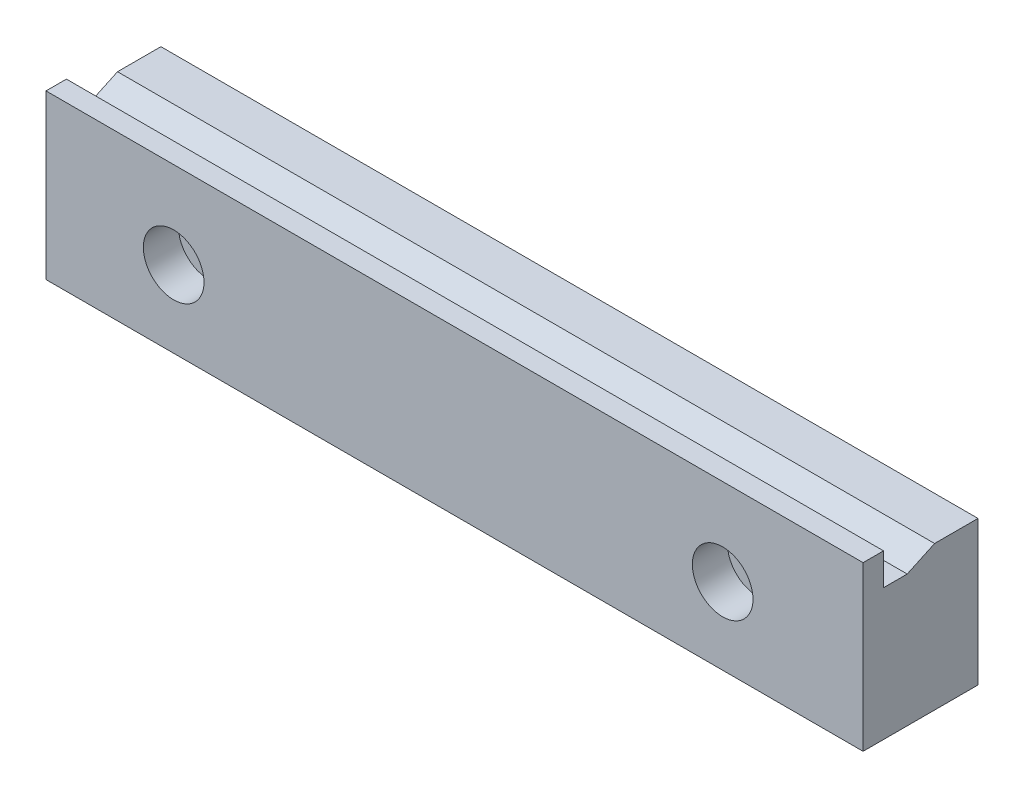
from build123d import *

# Parameters (mm, degrees)
SKETCH_1_W          = 128
SKETCH_1_H          = 25.6
SKETCH_1_R          = 2.75
EXTRUDE_1_DEPTH     = 18
SKETCH_2_R          = 4.75
CUT_EXTRUDE_1_DEPTH = 5.5
SKETCH_3_OUTSIDE_W  = 46.354
SKETCH_3_OUTSIDE_H  = 53.954
CUT_EXTRUDE_2_DEPTH = 132.770102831


with BuildPart() as part:
    # Sketch 1 → Extrude 1 (new body)
    with BuildSketch(Plane.XY):
        with Locations((64, 12.8)):
            Rectangle(SKETCH_1_W, SKETCH_1_H)
        with Locations((106, 12)):
            Circle(SKETCH_1_R, mode=Mode.SUBTRACT)
        with Locations((20, 12)):
            Circle(SKETCH_1_R, mode=Mode.SUBTRACT)
    extrude(amount=EXTRUDE_1_DEPTH)

    # Sketch 2 → Cut-Extrude 1 (cut)
    with BuildSketch(Plane.XY.offset(18)):
        with Locations((106, 12)):
            Circle(SKETCH_2_R)
        with Locations((20, 12)):
            Circle(SKETCH_2_R)
    extrude(amount=-CUT_EXTRUDE_1_DEPTH, mode=Mode.SUBTRACT)

    # Sketch 3 outside → Cut-Extrude 2 (cut, through all)
    with BuildSketch(Plane(origin=(128, 0, 0), x_dir=(0, 0, -1), z_dir=(1, 0, 0))):
        with Locations((-9, 12.8)):
            Rectangle(SKETCH_3_OUTSIDE_W, SKETCH_3_OUTSIDE_H)
        Polygon((-18, 0), (0, 0), (0, 22.6), (-6.8, 22.6), (-11.089013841, 20.6), (-14.8, 20.6), (-14.8, 25.6), (-18, 25.6), align=None, mode=Mode.SUBTRACT)
    extrude(amount=-CUT_EXTRUDE_2_DEPTH, mode=Mode.SUBTRACT)


solid = part.part
